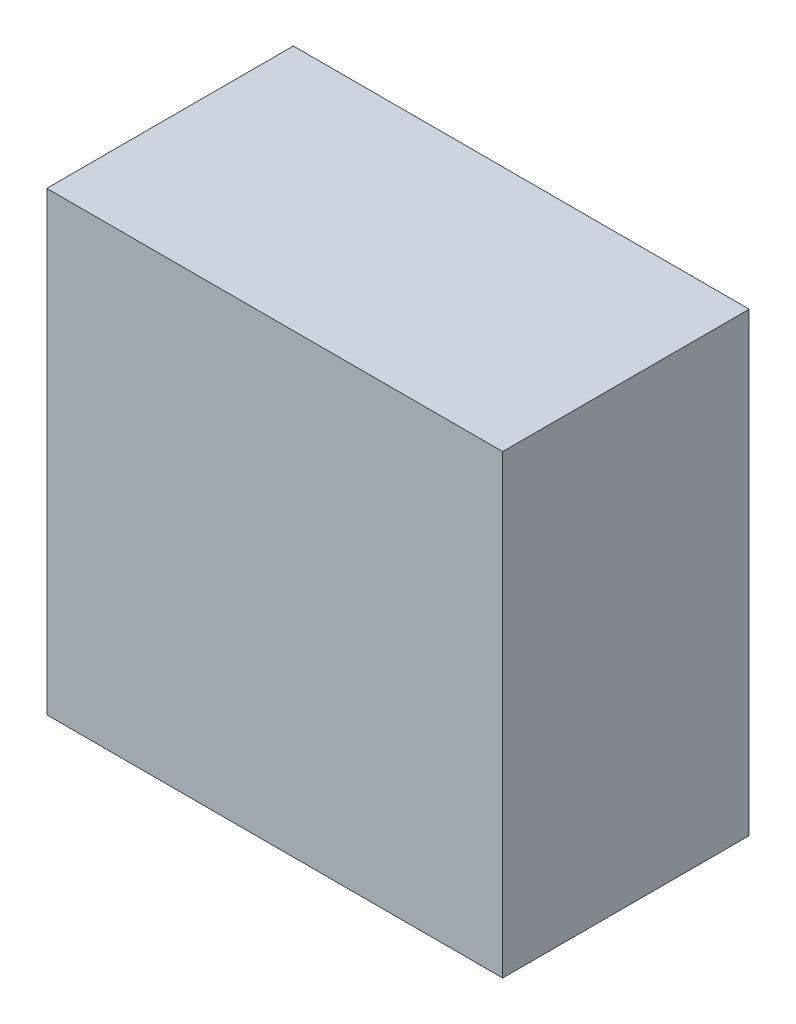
ISO-10303-21;
HEADER;
FILE_DESCRIPTION(('STEP AP214'),'2;1');
FILE_NAME('part.step','',(''),(''),'','','');
FILE_SCHEMA(('AUTOMOTIVE_DESIGN { 1 0 10303 214 1 1 1 1 }'));
ENDSEC;
DATA;
#1=APPLICATION_CONTEXT('core data for automotive mechanical design processes');
#2=APPLICATION_PROTOCOL_DEFINITION('international standard','automotive_design',2000,#1);
#3=PRODUCT_CONTEXT('',#1,'mechanical');
#4=PRODUCT('Part','Part','',(#3));
#5=PRODUCT_RELATED_PRODUCT_CATEGORY('part','',(#4));
#6=PRODUCT_DEFINITION_FORMATION('','',#4);
#7=PRODUCT_DEFINITION_CONTEXT('part definition',#1,'design');
#8=PRODUCT_DEFINITION('design','',#6,#7);
#9=PRODUCT_DEFINITION_SHAPE('','',#8);
#10=(LENGTH_UNIT() NAMED_UNIT(*) SI_UNIT(.MILLI.,.METRE.));
#11=(NAMED_UNIT(*) PLANE_ANGLE_UNIT() SI_UNIT($,.RADIAN.));
#12=(NAMED_UNIT(*) SI_UNIT($,.STERADIAN.) SOLID_ANGLE_UNIT());
#13=UNCERTAINTY_MEASURE_WITH_UNIT(LENGTH_MEASURE(1.E-05),#10,'distance_accuracy_value','');
#14=(GEOMETRIC_REPRESENTATION_CONTEXT(3) GLOBAL_UNCERTAINTY_ASSIGNED_CONTEXT((#13)) GLOBAL_UNIT_ASSIGNED_CONTEXT((#10,
#11,#12)) REPRESENTATION_CONTEXT('',''));
#15=CARTESIAN_POINT('',(0.,0.,0.));
#16=DIRECTION('',(0.,0.,1.));
#17=DIRECTION('',(1.,0.,0.));
#18=AXIS2_PLACEMENT_3D('',#15,#16,#17);
#19=CARTESIAN_POINT('',(26.2499996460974,-40.5000024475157,136.450001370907));
#20=DIRECTION('',(0.,0.,1.));
#21=DIRECTION('',(1.,0.,0.));
#22=AXIS2_PLACEMENT_3D('',#19,#20,#21);
#23=PLANE('',#22);
#24=DIRECTION('',(0.,1.,0.));
#25=VECTOR('',#24,1.);
#26=CARTESIAN_POINT('',(-3.75400017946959,-40.5000024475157,136.450001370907));
#27=LINE('',#26,#25);
#28=CARTESIAN_POINT('',(-3.75400017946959,-10.4960026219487,136.450001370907));
#29=VERTEX_POINT('',#28);
#30=CARTESIAN_POINT('',(-3.75400017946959,-70.5040022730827,136.450001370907));
#31=VERTEX_POINT('',#30);
#32=EDGE_CURVE('E20',#29,#31,#27,.F.);
#33=ORIENTED_EDGE('',*,*,#32,.F.);
#34=DIRECTION('',(1.,0.,0.));
#35=VECTOR('',#34,1.);
#36=CARTESIAN_POINT('',(26.2499996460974,-10.4960026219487,136.450001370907));
#37=LINE('',#36,#35);
#38=CARTESIAN_POINT('',(56.2539994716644,-10.4960026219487,136.450001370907));
#39=VERTEX_POINT('',#38);
#40=EDGE_CURVE('E80',#39,#29,#37,.F.);
#41=ORIENTED_EDGE('',*,*,#40,.F.);
#42=DIRECTION('',(0.,1.,0.));
#43=VECTOR('',#42,1.);
#44=CARTESIAN_POINT('',(56.2539994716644,-40.5000024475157,136.450001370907));
#45=LINE('',#44,#43);
#46=CARTESIAN_POINT('',(56.2539994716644,-70.5040022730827,136.450001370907));
#47=VERTEX_POINT('',#46);
#48=EDGE_CURVE('E68',#47,#39,#45,.T.);
#49=ORIENTED_EDGE('',*,*,#48,.F.);
#50=DIRECTION('',(1.,0.,0.));
#51=VECTOR('',#50,1.);
#52=CARTESIAN_POINT('',(26.2499996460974,-70.5040022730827,136.450001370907));
#53=LINE('',#52,#51);
#54=EDGE_CURVE('E55',#31,#47,#53,.T.);
#55=ORIENTED_EDGE('',*,*,#54,.F.);
#56=EDGE_LOOP('',(#33,#41,#49,#55));
#57=FACE_BOUND('',#56,.T.);
#58=ADVANCED_FACE('F17',(#57),#23,.F.);
#59=CARTESIAN_POINT('',(-3.75400017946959,-40.5000024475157,136.450001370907));
#60=DIRECTION('',(-1.,0.,0.));
#61=DIRECTION('',(0.,0.,1.));
#62=AXIS2_PLACEMENT_3D('',#59,#60,#61);
#63=PLANE('',#62);
#64=ORIENTED_EDGE('',*,*,#32,.T.);
#65=DIRECTION('',(0.,0.,-1.));
#66=VECTOR('',#65,1.);
#67=CARTESIAN_POINT('',(-3.75400017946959,-70.5040022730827,136.450001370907));
#68=LINE('',#67,#66);
#69=CARTESIAN_POINT('',(-3.75400017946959,-70.5040022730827,168.907077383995));
#70=VERTEX_POINT('',#69);
#71=EDGE_CURVE('E61',#70,#31,#68,.T.);
#72=ORIENTED_EDGE('',*,*,#71,.F.);
#73=DIRECTION('',(0.,1.,0.));
#74=VECTOR('',#73,1.);
#75=CARTESIAN_POINT('',(-3.75400017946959,-40.5000024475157,168.907077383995));
#76=LINE('',#75,#74);
#77=CARTESIAN_POINT('',(-3.75400017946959,-10.4960026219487,168.907077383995));
#78=VERTEX_POINT('',#77);
#79=EDGE_CURVE('E83',#78,#70,#76,.F.);
#80=ORIENTED_EDGE('',*,*,#79,.F.);
#81=DIRECTION('',(0.,0.,1.));
#82=VECTOR('',#81,1.);
#83=CARTESIAN_POINT('',(-3.75400017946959,-10.4960026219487,136.450001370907));
#84=LINE('',#83,#82);
#85=EDGE_CURVE('E64',#29,#78,#84,.T.);
#86=ORIENTED_EDGE('',*,*,#85,.F.);
#87=EDGE_LOOP('',(#64,#72,#80,#86));
#88=FACE_BOUND('',#87,.T.);
#89=ADVANCED_FACE('F60',(#88),#63,.T.);
#90=CARTESIAN_POINT('',(26.2499996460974,-70.5040022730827,136.450001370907));
#91=DIRECTION('',(0.,-1.,0.));
#92=DIRECTION('',(0.,0.,-1.));
#93=AXIS2_PLACEMENT_3D('',#90,#91,#92);
#94=PLANE('',#93);
#95=ORIENTED_EDGE('',*,*,#54,.T.);
#96=DIRECTION('',(0.,0.,-1.));
#97=VECTOR('',#96,1.);
#98=CARTESIAN_POINT('',(56.2539994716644,-70.5040022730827,136.450001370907));
#99=LINE('',#98,#97);
#100=CARTESIAN_POINT('',(56.2539994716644,-70.5040022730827,168.907077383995));
#101=VERTEX_POINT('',#100);
#102=EDGE_CURVE('E70',#101,#47,#99,.T.);
#103=ORIENTED_EDGE('',*,*,#102,.F.);
#104=DIRECTION('',(1.,0.,0.));
#105=VECTOR('',#104,1.);
#106=CARTESIAN_POINT('',(26.2499996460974,-70.5040022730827,168.907077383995));
#107=LINE('',#106,#105);
#108=EDGE_CURVE('E74',#70,#101,#107,.T.);
#109=ORIENTED_EDGE('',*,*,#108,.F.);
#110=ORIENTED_EDGE('',*,*,#71,.T.);
#111=EDGE_LOOP('',(#95,#103,#109,#110));
#112=FACE_BOUND('',#111,.T.);
#113=ADVANCED_FACE('F72',(#112),#94,.T.);
#114=CARTESIAN_POINT('',(56.2539994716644,-40.5000024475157,136.450001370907));
#115=DIRECTION('',(1.,0.,0.));
#116=DIRECTION('',(0.,0.,-1.));
#117=AXIS2_PLACEMENT_3D('',#114,#115,#116);
#118=PLANE('',#117);
#119=ORIENTED_EDGE('',*,*,#48,.T.);
#120=DIRECTION('',(0.,0.,1.));
#121=VECTOR('',#120,1.);
#122=CARTESIAN_POINT('',(56.2539994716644,-10.4960026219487,136.450001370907));
#123=LINE('',#122,#121);
#124=CARTESIAN_POINT('',(56.2539994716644,-10.4960026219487,168.907077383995));
#125=VERTEX_POINT('',#124);
#126=EDGE_CURVE('E35',#125,#39,#123,.F.);
#127=ORIENTED_EDGE('',*,*,#126,.F.);
#128=DIRECTION('',(0.,1.,0.));
#129=VECTOR('',#128,1.);
#130=CARTESIAN_POINT('',(56.2539994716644,-40.5000024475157,168.907077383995));
#131=LINE('',#130,#129);
#132=EDGE_CURVE('E26',#101,#125,#131,.T.);
#133=ORIENTED_EDGE('',*,*,#132,.F.);
#134=ORIENTED_EDGE('',*,*,#102,.T.);
#135=EDGE_LOOP('',(#119,#127,#133,#134));
#136=FACE_BOUND('',#135,.T.);
#137=ADVANCED_FACE('F89',(#136),#118,.T.);
#138=CARTESIAN_POINT('',(26.2499996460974,-10.4960026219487,136.450001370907));
#139=DIRECTION('',(0.,1.,0.));
#140=DIRECTION('',(0.,0.,1.));
#141=AXIS2_PLACEMENT_3D('',#138,#139,#140);
#142=PLANE('',#141);
#143=ORIENTED_EDGE('',*,*,#40,.T.);
#144=ORIENTED_EDGE('',*,*,#85,.T.);
#145=DIRECTION('',(1.,0.,0.));
#146=VECTOR('',#145,1.);
#147=CARTESIAN_POINT('',(26.2499996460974,-10.4960026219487,168.907077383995));
#148=LINE('',#147,#146);
#149=EDGE_CURVE('E11',#125,#78,#148,.F.);
#150=ORIENTED_EDGE('',*,*,#149,.F.);
#151=ORIENTED_EDGE('',*,*,#126,.T.);
#152=EDGE_LOOP('',(#143,#144,#150,#151));
#153=FACE_BOUND('',#152,.T.);
#154=ADVANCED_FACE('F91',(#153),#142,.T.);
#155=CARTESIAN_POINT('',(26.2499996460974,-40.5000024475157,168.907077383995));
#156=DIRECTION('',(0.,0.,1.));
#157=DIRECTION('',(1.,0.,0.));
#158=AXIS2_PLACEMENT_3D('',#155,#156,#157);
#159=PLANE('',#158);
#160=ORIENTED_EDGE('',*,*,#132,.T.);
#161=ORIENTED_EDGE('',*,*,#149,.T.);
#162=ORIENTED_EDGE('',*,*,#79,.T.);
#163=ORIENTED_EDGE('',*,*,#108,.T.);
#164=EDGE_LOOP('',(#160,#161,#162,#163));
#165=FACE_BOUND('',#164,.T.);
#166=ADVANCED_FACE('F88',(#165),#159,.T.);
#167=CLOSED_SHELL('',(#58,#89,#113,#137,#154,#166));
#168=MANIFOLD_SOLID_BREP('B1',#167);
#169=ADVANCED_BREP_SHAPE_REPRESENTATION('',(#18,#168),#14);
#170=SHAPE_DEFINITION_REPRESENTATION(#9,#169);
ENDSEC;
END-ISO-10303-21;
